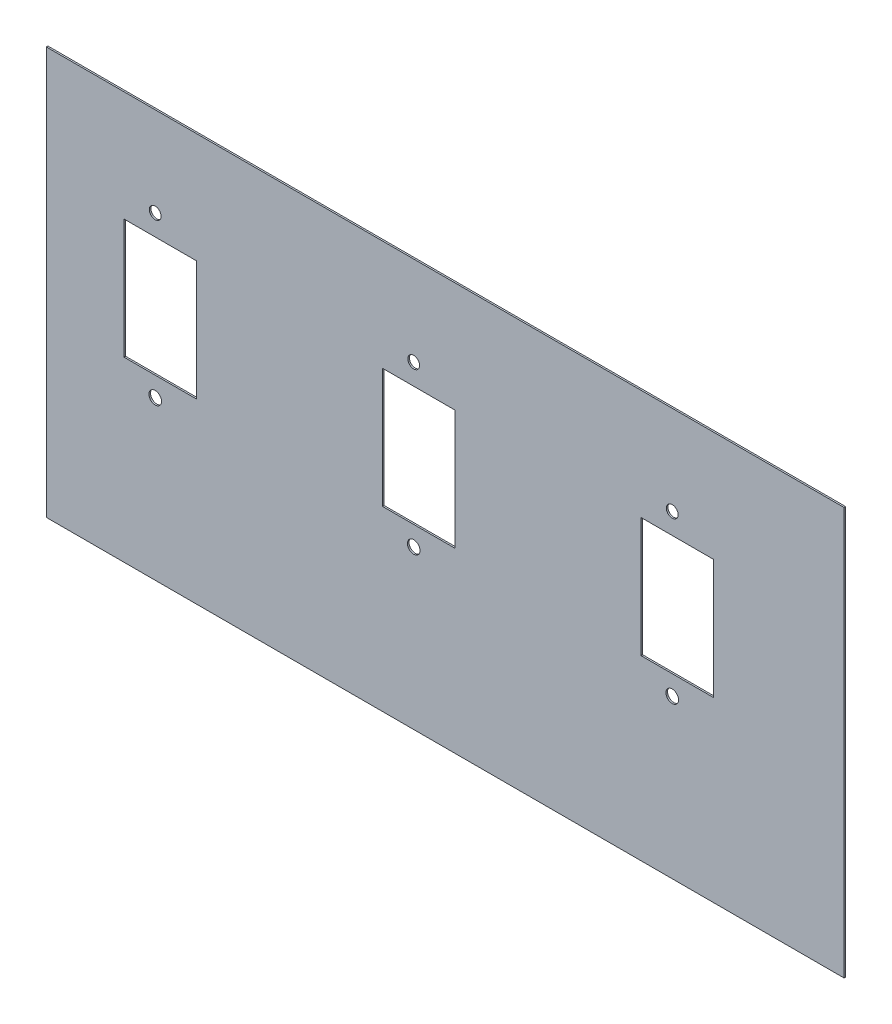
from build123d import *

# Parameters (mm, degrees)
SKETCH1_W               = 1261.969363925
SKETCH1_H               = 1289.192177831
EXTRUDE1_DEPTH          = 2.54
SKETCH2_W               = 114.426220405
SKETCH2_H               = 189.282777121
CUT_EXTRUDE1_DEPTH      = 1395.498273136
SKETCH3_R               = 9.334737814
SKETCH3_R_2             = 9.958839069
CUT_EXTRUDE2_DEPTH      = 1395.498273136
LPATTERN1_COUNT         = 2
LPATTERN1_PITCH         = 762
LPATTERN1_COUNT_DIR2    = 3
LPATTERN1_PITCH_DIR2    = 408.94
CUT_EXTRUDE3_DEPTH      = 1395.498273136
CUT_EXTRUDE3_DEPTH_BACK = 1395.498273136


with BuildPart() as part:
    # Sketch1 → Extrude1 (new body)
    with BuildSketch(Plane.XY):
        with Locations((338.050068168, -358.195332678)):
            Rectangle(SKETCH1_W, SKETCH1_H)
    extrude(amount=EXTRUDE1_DEPTH)

    # Sketch2 → Cut-Extrude1 (cut, through all)
    with BuildSketch(Plane.XY.offset(2.54)):
        with Locations((-112.860629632, 17.455225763)):
            Rectangle(SKETCH2_W, SKETCH2_H)
    cut_extrude1 = extrude(amount=-CUT_EXTRUDE1_DEPTH, mode=Mode.SUBTRACT)

    # Sketch3 → Cut-Extrude2 (cut, through all)
    with BuildSketch(Plane.XY.offset(2.54)):
        with Locations((-120.68336915, 145.099046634)):
            Circle(SKETCH3_R)
        with Locations((-120.68336915, -108.095305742)):
            Circle(SKETCH3_R_2)
    cut_extrude2 = extrude(amount=-CUT_EXTRUDE2_DEPTH, mode=Mode.SUBTRACT)

    # LPattern1: Cut-Extrude1, Cut-Extrude2 2 × 3
    with Locations(*[(j * LPATTERN1_PITCH_DIR2, -i * LPATTERN1_PITCH, 0) for i in range(LPATTERN1_COUNT) for j in range(LPATTERN1_COUNT_DIR2) if (i, j) != (0, 0)]):
        add(cut_extrude1, mode=Mode.SUBTRACT)
        add(cut_extrude2, mode=Mode.SUBTRACT)

    # Sketch4 → Cut-Extrude3 (cut, two sides: drawn at the far end of the back side and taken through both)
    with BuildSketch(Plane.XY.offset(2.54).offset(-CUT_EXTRUDE3_DEPTH_BACK)):
        Polygon((-3137.062905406, -358.195332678), (-292.934613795, -358.195332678), (969.03475013, -358.195332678), (3813.163041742, -358.195332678), (3813.163041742, -6046.451915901), (-3137.062905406, -6046.451915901), align=None)
    extrude(amount=CUT_EXTRUDE3_DEPTH + CUT_EXTRUDE3_DEPTH_BACK, mode=Mode.SUBTRACT)


solid = part.part
